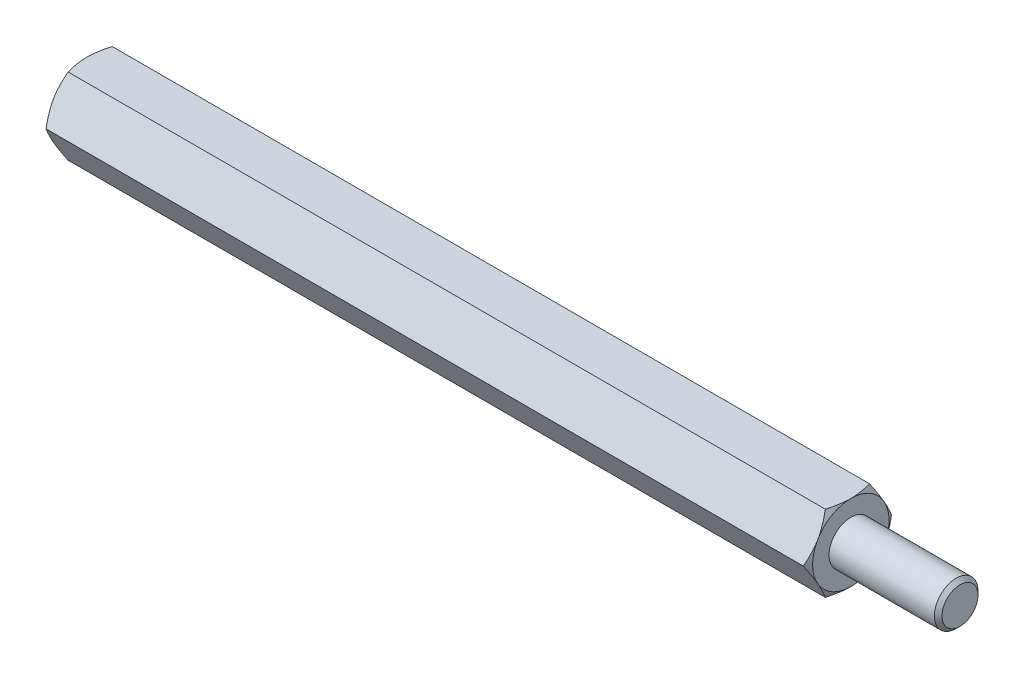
ISO-10303-21;
HEADER;
FILE_DESCRIPTION(('STEP AP214'),'2;1');
FILE_NAME('part.step','',(''),(''),'','','');
FILE_SCHEMA(('AUTOMOTIVE_DESIGN { 1 0 10303 214 1 1 1 1 }'));
ENDSEC;
DATA;
#1=APPLICATION_CONTEXT('core data for automotive mechanical design processes');
#2=APPLICATION_PROTOCOL_DEFINITION('international standard','automotive_design',2000,#1);
#3=PRODUCT_CONTEXT('',#1,'mechanical');
#4=PRODUCT('Part','Part','',(#3));
#5=PRODUCT_RELATED_PRODUCT_CATEGORY('part','',(#4));
#6=PRODUCT_DEFINITION_FORMATION('','',#4);
#7=PRODUCT_DEFINITION_CONTEXT('part definition',#1,'design');
#8=PRODUCT_DEFINITION('design','',#6,#7);
#9=PRODUCT_DEFINITION_SHAPE('','',#8);
#10=(LENGTH_UNIT() NAMED_UNIT(*) SI_UNIT(.MILLI.,.METRE.));
#11=(NAMED_UNIT(*) PLANE_ANGLE_UNIT() SI_UNIT($,.RADIAN.));
#12=(NAMED_UNIT(*) SI_UNIT($,.STERADIAN.) SOLID_ANGLE_UNIT());
#13=UNCERTAINTY_MEASURE_WITH_UNIT(LENGTH_MEASURE(1.E-05),#10,'distance_accuracy_value','');
#14=(GEOMETRIC_REPRESENTATION_CONTEXT(3) GLOBAL_UNCERTAINTY_ASSIGNED_CONTEXT((#13)) GLOBAL_UNIT_ASSIGNED_CONTEXT((#10,
#11,#12)) REPRESENTATION_CONTEXT('',''));
#15=CARTESIAN_POINT('',(0.,0.,0.));
#16=DIRECTION('',(0.,0.,1.));
#17=DIRECTION('',(1.,0.,0.));
#18=AXIS2_PLACEMENT_3D('',#15,#16,#17);
#19=CARTESIAN_POINT('',(35.,3.5,-2.02072594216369));
#20=DIRECTION('',(1.,0.,0.));
#21=DIRECTION('',(0.,0.,-1.));
#22=AXIS2_PLACEMENT_3D('',#19,#20,#21);
#23=PLANE('',#22);
#24=CARTESIAN_POINT('',(35.,0.,0.));
#25=DIRECTION('',(1.,0.,0.));
#26=DIRECTION('',(0.,0.,-1.));
#27=AXIS2_PLACEMENT_3D('',#24,#25,#26);
#28=CIRCLE('',#27,3.50000000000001);
#29=CARTESIAN_POINT('',(35.,-1.75000000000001,-3.03108891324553));
#30=VERTEX_POINT('',#29);
#31=CARTESIAN_POINT('',(35.,1.75,-3.03108891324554));
#32=VERTEX_POINT('',#31);
#33=EDGE_CURVE('E288',#30,#32,#28,.T.);
#34=ORIENTED_EDGE('',*,*,#33,.T.);
#35=CARTESIAN_POINT('',(35.,3.5,0.));
#36=VERTEX_POINT('',#35);
#37=EDGE_CURVE('E53',#32,#36,#28,.T.);
#38=ORIENTED_EDGE('',*,*,#37,.T.);
#39=CARTESIAN_POINT('',(35.,1.75,3.03108891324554));
#40=VERTEX_POINT('',#39);
#41=EDGE_CURVE('E296',#36,#40,#28,.T.);
#42=ORIENTED_EDGE('',*,*,#41,.T.);
#43=CARTESIAN_POINT('',(35.,-1.75000000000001,3.03108891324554));
#44=VERTEX_POINT('',#43);
#45=EDGE_CURVE('E302',#40,#44,#28,.T.);
#46=ORIENTED_EDGE('',*,*,#45,.T.);
#47=CARTESIAN_POINT('',(35.,0.,0.));
#48=DIRECTION('',(-1.,0.,0.));
#49=DIRECTION('',(0.,-1.,0.));
#50=AXIS2_PLACEMENT_3D('',#47,#48,#49);
#51=CIRCLE('',#50,3.50000000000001);
#52=CARTESIAN_POINT('',(35.,-3.50000000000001,0.));
#53=VERTEX_POINT('',#52);
#54=EDGE_CURVE('E193',#53,#44,#51,.T.);
#55=ORIENTED_EDGE('',*,*,#54,.F.);
#56=EDGE_CURVE('E61',#53,#30,#28,.T.);
#57=ORIENTED_EDGE('',*,*,#56,.T.);
#58=EDGE_LOOP('',(#34,#38,#42,#46,#55,#57));
#59=FACE_BOUND('',#58,.T.);
#60=CARTESIAN_POINT('',(35.,0.,0.));
#61=DIRECTION('',(1.,0.,0.));
#62=DIRECTION('',(0.,0.,-1.));
#63=AXIS2_PLACEMENT_3D('',#60,#61,#62);
#64=CIRCLE('',#63,2.);
#65=CARTESIAN_POINT('',(35.,0.,-2.));
#66=VERTEX_POINT('',#65);
#67=EDGE_CURVE('E327',#66,#66,#64,.T.);
#68=ORIENTED_EDGE('',*,*,#67,.F.);
#69=EDGE_LOOP('',(#68));
#70=FACE_BOUND('',#69,.T.);
#71=ADVANCED_FACE('F37',(#59,#70),#23,.T.);
#72=CARTESIAN_POINT('',(35.,0.,-4.04145188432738));
#73=DIRECTION('',(0.,-0.5,0.866025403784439));
#74=DIRECTION('',(0.,-0.866025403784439,-0.5));
#75=AXIS2_PLACEMENT_3D('',#72,#73,#74);
#76=PLANE('',#75);
#77=CARTESIAN_POINT('',(34.6873259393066,-0.000200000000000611,-4.04156735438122));
#78=CARTESIAN_POINT('',(34.73861421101,0.153607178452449,-3.9527667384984));
#79=CARTESIAN_POINT('',(34.7852590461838,0.308742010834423,-3.86319960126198));
#80=CARTESIAN_POINT('',(34.8666781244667,0.62169800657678,-3.68251437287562));
#81=CARTESIAN_POINT('',(34.9014235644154,0.779524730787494,-3.59139307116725));
#82=CARTESIAN_POINT('',(34.9555099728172,1.09322221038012,-3.41027974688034));
#83=CARTESIAN_POINT('',(34.9752109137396,1.24904469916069,-3.32031559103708));
#84=CARTESIAN_POINT('',(34.9987298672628,1.56142288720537,-3.13996396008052));
#85=CARTESIAN_POINT('',(35.0025673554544,1.71797745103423,-3.04957714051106));
#86=CARTESIAN_POINT('',(34.994584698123,2.01050921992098,-2.88068384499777));
#87=CARTESIAN_POINT('',(34.9847245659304,2.1465302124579,-2.80215208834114));
#88=CARTESIAN_POINT('',(34.9534735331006,2.41768602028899,-2.64560020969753));
#89=CARTESIAN_POINT('',(34.9320719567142,2.55281989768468,-2.5675806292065));
#90=CARTESIAN_POINT('',(34.8785695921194,2.82453479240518,-2.41070596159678));
#91=CARTESIAN_POINT('',(34.8462420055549,2.96108141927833,-2.33187072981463));
#92=CARTESIAN_POINT('',(34.772871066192,3.2321380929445,-2.17537608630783));
#93=CARTESIAN_POINT('',(34.7318449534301,3.36665161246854,-2.09771466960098));
#94=CARTESIAN_POINT('',(34.6873259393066,3.5002,-2.02061047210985));
#95=B_SPLINE_CURVE_WITH_KNOTS('',3,(#77,#78,#79,#80,#81,#82,#83,#84,#85,#86,#87,#88,#89,#90,#91,
#92,#93,#94),.UNSPECIFIED.,.F.,.F.,(4,2,2,2,2,2,2,2,4),(0.,0.554793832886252,1.11092123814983,
1.65328467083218,2.19498204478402,2.66665130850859,3.13875761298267,3.62133612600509,
4.10296698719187),.UNSPECIFIED.);
#96=CARTESIAN_POINT('',(34.6873926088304,0.,-4.04145188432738));
#97=VERTEX_POINT('',#96);
#98=EDGE_CURVE('E339',#97,#32,#95,.T.);
#99=ORIENTED_EDGE('',*,*,#98,.F.);
#100=DIRECTION('',(-1.,0.,0.));
#101=VECTOR('',#100,1.);
#102=CARTESIAN_POINT('',(35.,0.,-4.04145188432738));
#103=LINE('',#102,#101);
#104=CARTESIAN_POINT('',(-34.6873926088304,0.,-4.04145188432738));
#105=VERTEX_POINT('',#104);
#106=EDGE_CURVE('E264',#97,#105,#103,.T.);
#107=ORIENTED_EDGE('',*,*,#106,.T.);
#108=CARTESIAN_POINT('',(-34.6873259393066,3.5002,-2.02061047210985));
#109=CARTESIAN_POINT('',(-34.73861421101,3.34639282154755,-2.10941108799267));
#110=CARTESIAN_POINT('',(-34.7852590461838,3.19125798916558,-2.19897822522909));
#111=CARTESIAN_POINT('',(-34.8666781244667,2.87830199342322,-2.37966345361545));
#112=CARTESIAN_POINT('',(-34.9014235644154,2.7204752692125,-2.47078475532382));
#113=CARTESIAN_POINT('',(-34.9555099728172,2.40677778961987,-2.65189807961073));
#114=CARTESIAN_POINT('',(-34.9752109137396,2.25095530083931,-2.74186223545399));
#115=CARTESIAN_POINT('',(-34.9987298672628,1.93857711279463,-2.92221386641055));
#116=CARTESIAN_POINT('',(-35.0025673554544,1.78202254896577,-3.01260068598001));
#117=CARTESIAN_POINT('',(-34.994584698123,1.48949078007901,-3.1814939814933));
#118=CARTESIAN_POINT('',(-34.9847245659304,1.35346978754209,-3.26002573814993));
#119=CARTESIAN_POINT('',(-34.9534735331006,1.082313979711,-3.41657761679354));
#120=CARTESIAN_POINT('',(-34.9320719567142,0.947180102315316,-3.49459719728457));
#121=CARTESIAN_POINT('',(-34.8785695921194,0.675465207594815,-3.65147186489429));
#122=CARTESIAN_POINT('',(-34.8462420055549,0.538918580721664,-3.73030709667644));
#123=CARTESIAN_POINT('',(-34.772871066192,0.267861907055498,-3.88680174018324));
#124=CARTESIAN_POINT('',(-34.7318449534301,0.133348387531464,-3.96446315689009));
#125=CARTESIAN_POINT('',(-34.6873259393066,-0.000199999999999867,-4.04156735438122));
#126=B_SPLINE_CURVE_WITH_KNOTS('',3,(#108,#109,#110,#111,#112,#113,#114,#115,#116,#117,#118,
#119,#120,#121,#122,#123,#124,#125),.UNSPECIFIED.,.F.,.F.,(4,2,2,2,2,2,2,2,4),(0.,
0.554793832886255,1.11092123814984,1.65328467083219,2.19498204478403,2.6666513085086,
3.13875761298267,3.6213361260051,4.10296698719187),.UNSPECIFIED.);
#127=CARTESIAN_POINT('',(-35.,1.75,-3.03108891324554));
#128=VERTEX_POINT('',#127);
#129=EDGE_CURVE('E314',#128,#105,#126,.T.);
#130=ORIENTED_EDGE('',*,*,#129,.F.);
#131=CARTESIAN_POINT('',(-34.6873926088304,3.5,-2.02072594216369));
#132=VERTEX_POINT('',#131);
#133=EDGE_CURVE('E337',#132,#128,#126,.T.);
#134=ORIENTED_EDGE('',*,*,#133,.F.);
#135=DIRECTION('',(-1.,0.,0.));
#136=VECTOR('',#135,1.);
#137=CARTESIAN_POINT('',(35.,3.5,-2.02072594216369));
#138=LINE('',#137,#136);
#139=CARTESIAN_POINT('',(34.6873926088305,3.5,-2.02072594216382));
#140=VERTEX_POINT('',#139);
#141=EDGE_CURVE('E279',#140,#132,#138,.T.);
#142=ORIENTED_EDGE('',*,*,#141,.F.);
#143=EDGE_CURVE('E229',#32,#140,#95,.T.);
#144=ORIENTED_EDGE('',*,*,#143,.F.);
#145=EDGE_LOOP('',(#99,#107,#130,#134,#142,#144));
#146=FACE_BOUND('',#145,.T.);
#147=ADVANCED_FACE('F148',(#146),#76,.F.);
#148=CARTESIAN_POINT('',(35.,3.5,-2.02072594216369));
#149=DIRECTION('',(0.,-1.,0.));
#150=DIRECTION('',(0.,0.,-1.));
#151=AXIS2_PLACEMENT_3D('',#148,#149,#150);
#152=PLANE('',#151);
#153=CARTESIAN_POINT('',(33.2443294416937,3.5,-5.525713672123));
#154=CARTESIAN_POINT('',(33.3192813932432,3.5,-5.37200190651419));
#155=CARTESIAN_POINT('',(33.393542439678,3.5,-5.21794762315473));
#156=CARTESIAN_POINT('',(33.5402960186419,3.5,-4.90897223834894));
#157=CARTESIAN_POINT('',(33.6127882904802,3.5,-4.75405101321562));
#158=CARTESIAN_POINT('',(33.7559617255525,3.5,-4.44240758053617));
#159=CARTESIAN_POINT('',(33.8266316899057,3.5,-4.28568021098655));
#160=CARTESIAN_POINT('',(33.9652074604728,3.5,-3.97101270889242));
#161=CARTESIAN_POINT('',(34.0331133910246,3.5,-3.81307263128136));
#162=CARTESIAN_POINT('',(34.1677143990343,3.5,-3.49026114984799));
#163=CARTESIAN_POINT('',(34.2342871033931,3.5,-3.32533845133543));
#164=CARTESIAN_POINT('',(34.3626267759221,3.5,-2.99359992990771));
#165=CARTESIAN_POINT('',(34.4243932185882,3.5,-2.82678390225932));
#166=CARTESIAN_POINT('',(34.5415700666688,3.5,-2.49127529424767));
#167=CARTESIAN_POINT('',(34.5969925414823,3.5,-2.32258697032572));
#168=CARTESIAN_POINT('',(34.6997679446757,3.5,-1.98279215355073));
#169=CARTESIAN_POINT('',(34.7471233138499,3.5,-1.81168640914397));
#170=CARTESIAN_POINT('',(34.8312987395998,3.5,-1.46793354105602));
#171=CARTESIAN_POINT('',(34.8681796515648,3.5,-1.2953015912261));
#172=CARTESIAN_POINT('',(34.9293955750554,3.5,-0.947791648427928));
#173=CARTESIAN_POINT('',(34.953731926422,3.5,-0.772913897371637));
#174=CARTESIAN_POINT('',(34.9876038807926,3.5,-0.424108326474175));
#175=CARTESIAN_POINT('',(34.997337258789,3.5,-0.250200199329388));
#176=CARTESIAN_POINT('',(35.0017053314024,3.5,0.0978233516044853));
#177=CARTESIAN_POINT('',(34.9963399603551,3.5,0.271938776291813));
#178=CARTESIAN_POINT('',(34.9750118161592,3.5,0.564711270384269));
#179=CARTESIAN_POINT('',(34.9628919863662,3.5,0.6836676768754));
#180=CARTESIAN_POINT('',(34.9323080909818,3.5,0.920767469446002));
#181=CARTESIAN_POINT('',(34.9138432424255,3.5,1.03891075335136));
#182=CARTESIAN_POINT('',(34.8498956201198,3.5,1.39193174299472));
#183=CARTESIAN_POINT('',(34.7958695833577,3.5,1.62528232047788));
#184=CARTESIAN_POINT('',(34.7014515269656,3.5,1.97433825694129));
#185=CARTESIAN_POINT('',(34.6672900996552,3.5,2.09183268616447));
#186=CARTESIAN_POINT('',(34.595234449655,3.5,2.32568238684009));
#187=CARTESIAN_POINT('',(34.5573401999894,3.5,2.44203765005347));
#188=CARTESIAN_POINT('',(34.4784421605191,3.5,2.67364238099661));
#189=CARTESIAN_POINT('',(34.4374392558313,3.5,2.7888921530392));
#190=CARTESIAN_POINT('',(34.352824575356,3.5,3.0184246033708));
#191=CARTESIAN_POINT('',(34.3092128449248,3.5,3.13270729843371));
#192=CARTESIAN_POINT('',(34.1958241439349,3.5,3.42150510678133));
#193=CARTESIAN_POINT('',(34.1245636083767,3.5,3.59543696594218));
#194=CARTESIAN_POINT('',(33.9781026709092,3.5,3.94163961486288));
#195=CARTESIAN_POINT('',(33.9029019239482,3.5,4.11391025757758));
#196=CARTESIAN_POINT('',(33.7494252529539,3.5,4.45713072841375));
#197=CARTESIAN_POINT('',(33.6711484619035,3.5,4.62808016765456));
#198=CARTESIAN_POINT('',(33.512188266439,3.5,4.96885843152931));
#199=CARTESIAN_POINT('',(33.4315047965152,3.5,5.1386872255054));
#200=CARTESIAN_POINT('',(33.1863871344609,3.5,5.64726192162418));
#201=CARTESIAN_POINT('',(33.0190975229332,3.5,5.98463020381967));
#202=CARTESIAN_POINT('',(32.6795854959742,3.5,6.65678495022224));
#203=CARTESIAN_POINT('',(32.5073639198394,3.5,6.99157184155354));
#204=CARTESIAN_POINT('',(32.1760800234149,3.5,7.62749570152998));
#205=CARTESIAN_POINT('',(32.0173299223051,3.5,7.92879562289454));
#206=CARTESIAN_POINT('',(31.6977473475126,3.5,8.53030635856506));
#207=CARTESIAN_POINT('',(31.5369147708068,3.5,8.83051711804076));
#208=CARTESIAN_POINT('',(31.2141792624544,3.5,9.42918006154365));
#209=CARTESIAN_POINT('',(31.0522810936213,3.5,9.72763481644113));
#210=CARTESIAN_POINT('',(30.7272737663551,3.5,10.3238577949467));
#211=CARTESIAN_POINT('',(30.5641646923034,3.5,10.6216260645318));
#212=CARTESIAN_POINT('',(30.4006104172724,3.5,10.9191478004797));
#213=B_SPLINE_CURVE_WITH_KNOTS('',3,(#153,#154,#155,#156,#157,#158,#159,#160,#161,#162,#163,
#164,#165,#166,#167,#168,#169,#170,#171,#172,#173,#174,#175,#176,#177,#178,#179,#180,#181,#182,
#183,#184,#185,#186,#187,#188,#189,#190,#191,#192,#193,#194,#195,#196,#197,#198,#199,#200,#201,
#202,#203,#204,#205,#206,#207,#208,#209,#210,#211,#212),.UNSPECIFIED.,.F.,.F.,(4,2,2,2,2,2,2,2,
2,2,2,2,2,2,2,2,2,2,2,2,2,2,2,2,2,2,2,2,2,4),(0.,0.513041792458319,1.02615874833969,
1.54190801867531,2.05763406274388,2.59113284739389,3.1246898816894,3.65721433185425,
4.18957737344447,4.71878103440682,5.24792816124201,5.76984197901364,6.29175806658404,
6.65030258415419,7.00889136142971,7.72642330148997,8.0934692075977,8.46051776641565,
8.82746220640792,9.19440026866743,9.75822236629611,10.3220939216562,10.8861255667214,
11.4501725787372,12.579801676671,13.7092396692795,14.730918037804,15.7526471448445,
16.771258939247,17.7898004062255),.UNSPECIFIED.);
#214=EDGE_CURVE('E227',#140,#36,#213,.T.);
#215=ORIENTED_EDGE('',*,*,#214,.F.);
#216=ORIENTED_EDGE('',*,*,#141,.T.);
#217=CARTESIAN_POINT('',(-33.2443294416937,3.5,-5.525713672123));
#218=CARTESIAN_POINT('',(-33.3192813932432,3.5,-5.37200190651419));
#219=CARTESIAN_POINT('',(-33.393542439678,3.5,-5.21794762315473));
#220=CARTESIAN_POINT('',(-33.5402960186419,3.5,-4.90897223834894));
#221=CARTESIAN_POINT('',(-33.6127882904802,3.5,-4.75405101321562));
#222=CARTESIAN_POINT('',(-33.7559617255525,3.5,-4.44240758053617));
#223=CARTESIAN_POINT('',(-33.8266316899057,3.5,-4.28568021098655));
#224=CARTESIAN_POINT('',(-33.9652074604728,3.5,-3.97101270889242));
#225=CARTESIAN_POINT('',(-34.0331133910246,3.5,-3.81307263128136));
#226=CARTESIAN_POINT('',(-34.1677143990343,3.5,-3.49026114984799));
#227=CARTESIAN_POINT('',(-34.2342871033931,3.5,-3.32533845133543));
#228=CARTESIAN_POINT('',(-34.3626267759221,3.5,-2.99359992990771));
#229=CARTESIAN_POINT('',(-34.4243932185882,3.5,-2.82678390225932));
#230=CARTESIAN_POINT('',(-34.5415700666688,3.5,-2.49127529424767));
#231=CARTESIAN_POINT('',(-34.5969925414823,3.5,-2.32258697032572));
#232=CARTESIAN_POINT('',(-34.6997679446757,3.5,-1.98279215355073));
#233=CARTESIAN_POINT('',(-34.7471233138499,3.5,-1.81168640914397));
#234=CARTESIAN_POINT('',(-34.8312987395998,3.5,-1.46793354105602));
#235=CARTESIAN_POINT('',(-34.8681796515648,3.5,-1.2953015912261));
#236=CARTESIAN_POINT('',(-34.9293955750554,3.5,-0.947791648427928));
#237=CARTESIAN_POINT('',(-34.953731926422,3.5,-0.772913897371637));
#238=CARTESIAN_POINT('',(-34.9876038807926,3.5,-0.424108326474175));
#239=CARTESIAN_POINT('',(-34.997337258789,3.5,-0.250200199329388));
#240=CARTESIAN_POINT('',(-35.0017053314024,3.5,0.0978233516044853));
#241=CARTESIAN_POINT('',(-34.9963399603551,3.5,0.271938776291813));
#242=CARTESIAN_POINT('',(-34.9750118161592,3.5,0.564711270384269));
#243=CARTESIAN_POINT('',(-34.9628919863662,3.5,0.6836676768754));
#244=CARTESIAN_POINT('',(-34.9323080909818,3.5,0.920767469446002));
#245=CARTESIAN_POINT('',(-34.9138432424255,3.5,1.03891075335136));
#246=CARTESIAN_POINT('',(-34.8498956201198,3.5,1.39193174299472));
#247=CARTESIAN_POINT('',(-34.7958695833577,3.5,1.62528232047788));
#248=CARTESIAN_POINT('',(-34.7014515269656,3.5,1.97433825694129));
#249=CARTESIAN_POINT('',(-34.6672900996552,3.5,2.09183268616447));
#250=CARTESIAN_POINT('',(-34.595234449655,3.5,2.32568238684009));
#251=CARTESIAN_POINT('',(-34.5573401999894,3.5,2.44203765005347));
#252=CARTESIAN_POINT('',(-34.4784421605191,3.5,2.67364238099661));
#253=CARTESIAN_POINT('',(-34.4374392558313,3.5,2.7888921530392));
#254=CARTESIAN_POINT('',(-34.352824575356,3.5,3.0184246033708));
#255=CARTESIAN_POINT('',(-34.3092128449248,3.5,3.13270729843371));
#256=CARTESIAN_POINT('',(-34.1958241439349,3.5,3.42150510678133));
#257=CARTESIAN_POINT('',(-34.1245636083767,3.5,3.59543696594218));
#258=CARTESIAN_POINT('',(-33.9781026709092,3.5,3.94163961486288));
#259=CARTESIAN_POINT('',(-33.9029019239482,3.5,4.11391025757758));
#260=CARTESIAN_POINT('',(-33.7494252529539,3.5,4.45713072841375));
#261=CARTESIAN_POINT('',(-33.6711484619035,3.5,4.62808016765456));
#262=CARTESIAN_POINT('',(-33.512188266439,3.5,4.96885843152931));
#263=CARTESIAN_POINT('',(-33.4315047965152,3.5,5.1386872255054));
#264=CARTESIAN_POINT('',(-33.1863871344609,3.5,5.64726192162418));
#265=CARTESIAN_POINT('',(-33.0190975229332,3.5,5.98463020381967));
#266=CARTESIAN_POINT('',(-32.6795854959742,3.5,6.65678495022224));
#267=CARTESIAN_POINT('',(-32.5073639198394,3.5,6.99157184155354));
#268=CARTESIAN_POINT('',(-32.1760800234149,3.5,7.62749570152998));
#269=CARTESIAN_POINT('',(-32.0173299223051,3.5,7.92879562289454));
#270=CARTESIAN_POINT('',(-31.6977473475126,3.5,8.53030635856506));
#271=CARTESIAN_POINT('',(-31.5369147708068,3.5,8.83051711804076));
#272=CARTESIAN_POINT('',(-31.2141792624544,3.5,9.42918006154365));
#273=CARTESIAN_POINT('',(-31.0522810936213,3.5,9.72763481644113));
#274=CARTESIAN_POINT('',(-30.7272737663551,3.5,10.3238577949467));
#275=CARTESIAN_POINT('',(-30.5641646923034,3.5,10.6216260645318));
#276=CARTESIAN_POINT('',(-30.4006104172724,3.5,10.9191478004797));
#277=B_SPLINE_CURVE_WITH_KNOTS('',3,(#217,#218,#219,#220,#221,#222,#223,#224,#225,#226,#227,
#228,#229,#230,#231,#232,#233,#234,#235,#236,#237,#238,#239,#240,#241,#242,#243,#244,#245,#246,
#247,#248,#249,#250,#251,#252,#253,#254,#255,#256,#257,#258,#259,#260,#261,#262,#263,#264,#265,
#266,#267,#268,#269,#270,#271,#272,#273,#274,#275,#276),.UNSPECIFIED.,.F.,.F.,(4,2,2,2,2,2,2,2,
2,2,2,2,2,2,2,2,2,2,2,2,2,2,2,2,2,2,2,2,2,4),(0.,0.513041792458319,1.02615874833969,
1.54190801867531,2.05763406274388,2.59113284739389,3.1246898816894,3.65721433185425,
4.18957737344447,4.71878103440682,5.24792816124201,5.76984197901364,6.29175806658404,
6.65030258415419,7.00889136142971,7.72642330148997,8.0934692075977,8.46051776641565,
8.82746220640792,9.19440026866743,9.75822236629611,10.3220939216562,10.8861255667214,
11.4501725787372,12.579801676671,13.7092396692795,14.730918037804,15.7526471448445,
16.771258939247,17.7898004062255),.UNSPECIFIED.);
#278=CARTESIAN_POINT('',(-35.,3.5,0.));
#279=VERTEX_POINT('',#278);
#280=EDGE_CURVE('E241',#279,#132,#277,.F.);
#281=ORIENTED_EDGE('',*,*,#280,.F.);
#282=CARTESIAN_POINT('',(-34.6873926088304,3.5,2.02072594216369));
#283=VERTEX_POINT('',#282);
#284=EDGE_CURVE('E249',#283,#279,#277,.F.);
#285=ORIENTED_EDGE('',*,*,#284,.F.);
#286=DIRECTION('',(-1.,0.,0.));
#287=VECTOR('',#286,1.);
#288=CARTESIAN_POINT('',(35.,3.5,2.02072594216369));
#289=LINE('',#288,#287);
#290=CARTESIAN_POINT('',(34.6873926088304,3.5,2.02072594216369));
#291=VERTEX_POINT('',#290);
#292=EDGE_CURVE('E276',#291,#283,#289,.T.);
#293=ORIENTED_EDGE('',*,*,#292,.F.);
#294=EDGE_CURVE('E221',#36,#291,#213,.T.);
#295=ORIENTED_EDGE('',*,*,#294,.F.);
#296=EDGE_LOOP('',(#215,#216,#281,#285,#293,#295));
#297=FACE_BOUND('',#296,.T.);
#298=ADVANCED_FACE('F153',(#297),#152,.F.);
#299=CARTESIAN_POINT('',(35.,3.5,2.02072594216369));
#300=DIRECTION('',(0.,-0.5,-0.866025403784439));
#301=DIRECTION('',(0.,0.866025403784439,-0.5));
#302=AXIS2_PLACEMENT_3D('',#299,#300,#301);
#303=PLANE('',#302);
#304=CARTESIAN_POINT('',(34.6873259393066,3.5002,2.02061047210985));
#305=CARTESIAN_POINT('',(34.73861421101,3.34639282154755,2.10941108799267));
#306=CARTESIAN_POINT('',(34.7852590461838,3.19125798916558,2.19897822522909));
#307=CARTESIAN_POINT('',(34.8666781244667,2.87830199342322,2.37966345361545));
#308=CARTESIAN_POINT('',(34.9014235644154,2.7204752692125,2.47078475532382));
#309=CARTESIAN_POINT('',(34.9555099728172,2.40677778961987,2.65189807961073));
#310=CARTESIAN_POINT('',(34.9752109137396,2.25095530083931,2.74186223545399));
#311=CARTESIAN_POINT('',(34.9987298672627,1.93857711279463,2.92221386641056));
#312=CARTESIAN_POINT('',(35.0025673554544,1.78202254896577,3.01260068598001));
#313=CARTESIAN_POINT('',(34.994584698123,1.48949078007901,3.1814939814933));
#314=CARTESIAN_POINT('',(34.9847245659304,1.35346978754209,3.26002573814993));
#315=CARTESIAN_POINT('',(34.9534735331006,1.082313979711,3.41657761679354));
#316=CARTESIAN_POINT('',(34.9320719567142,0.947180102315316,3.49459719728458));
#317=CARTESIAN_POINT('',(34.8785695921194,0.675465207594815,3.65147186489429));
#318=CARTESIAN_POINT('',(34.8462420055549,0.538918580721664,3.73030709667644));
#319=CARTESIAN_POINT('',(34.772871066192,0.267861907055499,3.88680174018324));
#320=CARTESIAN_POINT('',(34.7318449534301,0.133348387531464,3.96446315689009));
#321=CARTESIAN_POINT('',(34.6873259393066,-0.000199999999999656,4.04156735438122));
#322=B_SPLINE_CURVE_WITH_KNOTS('',3,(#304,#305,#306,#307,#308,#309,#310,#311,#312,#313,#314,
#315,#316,#317,#318,#319,#320,#321),.UNSPECIFIED.,.F.,.F.,(4,2,2,2,2,2,2,2,4),(0.,
0.554793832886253,1.11092123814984,1.65328467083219,2.19498204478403,2.6666513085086,
3.13875761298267,3.62133612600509,4.10296698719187),.UNSPECIFIED.);
#323=EDGE_CURVE('E228',#291,#40,#322,.T.);
#324=ORIENTED_EDGE('',*,*,#323,.F.);
#325=ORIENTED_EDGE('',*,*,#292,.T.);
#326=CARTESIAN_POINT('',(-34.6873259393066,-0.00020000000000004,4.04156735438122));
#327=CARTESIAN_POINT('',(-34.73861421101,0.153607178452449,3.9527667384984));
#328=CARTESIAN_POINT('',(-34.7852590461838,0.308742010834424,3.86319960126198));
#329=CARTESIAN_POINT('',(-34.8666781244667,0.621698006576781,3.68251437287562));
#330=CARTESIAN_POINT('',(-34.9014235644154,0.779524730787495,3.59139307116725));
#331=CARTESIAN_POINT('',(-34.9555099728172,1.09322221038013,3.41027974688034));
#332=CARTESIAN_POINT('',(-34.9752109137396,1.24904469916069,3.32031559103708));
#333=CARTESIAN_POINT('',(-34.9987298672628,1.56142288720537,3.13996396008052));
#334=CARTESIAN_POINT('',(-35.0025673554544,1.71797745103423,3.04957714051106));
#335=CARTESIAN_POINT('',(-34.994584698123,2.01050921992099,2.88068384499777));
#336=CARTESIAN_POINT('',(-34.9847245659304,2.1465302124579,2.80215208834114));
#337=CARTESIAN_POINT('',(-34.9534735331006,2.41768602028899,2.64560020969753));
#338=CARTESIAN_POINT('',(-34.9320719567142,2.55281989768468,2.5675806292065));
#339=CARTESIAN_POINT('',(-34.8785695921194,2.82453479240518,2.41070596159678));
#340=CARTESIAN_POINT('',(-34.8462420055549,2.96108141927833,2.33187072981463));
#341=CARTESIAN_POINT('',(-34.772871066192,3.2321380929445,2.17537608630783));
#342=CARTESIAN_POINT('',(-34.7318449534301,3.36665161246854,2.09771466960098));
#343=CARTESIAN_POINT('',(-34.6873259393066,3.5002,2.02061047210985));
#344=B_SPLINE_CURVE_WITH_KNOTS('',3,(#326,#327,#328,#329,#330,#331,#332,#333,#334,#335,#336,
#337,#338,#339,#340,#341,#342,#343),.UNSPECIFIED.,.F.,.F.,(4,2,2,2,2,2,2,2,4),(0.,
0.554793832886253,1.11092123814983,1.65328467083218,2.19498204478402,2.66665130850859,
3.13875761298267,3.62133612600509,4.10296698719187),.UNSPECIFIED.);
#345=CARTESIAN_POINT('',(-35.,1.75,3.03108891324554));
#346=VERTEX_POINT('',#345);
#347=EDGE_CURVE('E255',#346,#283,#344,.T.);
#348=ORIENTED_EDGE('',*,*,#347,.F.);
#349=CARTESIAN_POINT('',(-34.6873926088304,0.,4.04145188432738));
#350=VERTEX_POINT('',#349);
#351=EDGE_CURVE('E262',#350,#346,#344,.T.);
#352=ORIENTED_EDGE('',*,*,#351,.F.);
#353=DIRECTION('',(-1.,0.,0.));
#354=VECTOR('',#353,1.);
#355=CARTESIAN_POINT('',(35.,0.,4.04145188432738));
#356=LINE('',#355,#354);
#357=CARTESIAN_POINT('',(34.6873926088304,0.,4.04145188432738));
#358=VERTEX_POINT('',#357);
#359=EDGE_CURVE('E273',#358,#350,#356,.T.);
#360=ORIENTED_EDGE('',*,*,#359,.F.);
#361=EDGE_CURVE('E215',#40,#358,#322,.T.);
#362=ORIENTED_EDGE('',*,*,#361,.F.);
#363=EDGE_LOOP('',(#324,#325,#348,#352,#360,#362));
#364=FACE_BOUND('',#363,.T.);
#365=ADVANCED_FACE('F235',(#364),#303,.F.);
#366=CARTESIAN_POINT('',(35.,0.,4.04145188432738));
#367=DIRECTION('',(0.,0.5,-0.866025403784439));
#368=DIRECTION('',(0.,0.866025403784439,0.5));
#369=AXIS2_PLACEMENT_3D('',#366,#367,#368);
#370=PLANE('',#369);
#371=CARTESIAN_POINT('',(34.6873259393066,0.000199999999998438,4.04156735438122));
#372=CARTESIAN_POINT('',(34.73861421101,-0.153607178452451,3.9527667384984));
#373=CARTESIAN_POINT('',(34.7852590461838,-0.308742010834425,3.86319960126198));
#374=CARTESIAN_POINT('',(34.8666781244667,-0.621698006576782,3.68251437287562));
#375=CARTESIAN_POINT('',(34.9014235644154,-0.779524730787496,3.59139307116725));
#376=CARTESIAN_POINT('',(34.9555099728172,-1.09322221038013,3.41027974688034));
#377=CARTESIAN_POINT('',(34.9752109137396,-1.24904469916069,3.32031559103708));
#378=CARTESIAN_POINT('',(34.9987298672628,-1.56142288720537,3.13996396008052));
#379=CARTESIAN_POINT('',(35.0025673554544,-1.71797745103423,3.04957714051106));
#380=CARTESIAN_POINT('',(34.994584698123,-2.01050921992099,2.88068384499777));
#381=CARTESIAN_POINT('',(34.9847245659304,-2.1465302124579,2.80215208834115));
#382=CARTESIAN_POINT('',(34.9534735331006,-2.41768602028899,2.64560020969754));
#383=CARTESIAN_POINT('',(34.9320719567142,-2.55281989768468,2.5675806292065));
#384=CARTESIAN_POINT('',(34.8785695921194,-2.82453479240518,2.41070596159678));
#385=CARTESIAN_POINT('',(34.8462420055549,-2.96108141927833,2.33187072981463));
#386=CARTESIAN_POINT('',(34.772871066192,-3.2321380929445,2.17537608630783));
#387=CARTESIAN_POINT('',(34.7318449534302,-3.36665161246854,2.09771466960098));
#388=CARTESIAN_POINT('',(34.6873259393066,-3.5002,2.02061047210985));
#389=B_SPLINE_CURVE_WITH_KNOTS('',3,(#371,#372,#373,#374,#375,#376,#377,#378,#379,#380,#381,
#382,#383,#384,#385,#386,#387,#388),.UNSPECIFIED.,.F.,.F.,(4,2,2,2,2,2,2,2,4),(0.,
0.554793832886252,1.11092123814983,1.65328467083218,2.19498204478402,2.66665130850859,
3.13875761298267,3.62133612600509,4.10296698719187),.UNSPECIFIED.);
#390=EDGE_CURVE('E342',#358,#44,#389,.T.);
#391=ORIENTED_EDGE('',*,*,#390,.F.);
#392=ORIENTED_EDGE('',*,*,#359,.T.);
#393=CARTESIAN_POINT('',(-34.6873259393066,-3.5002,2.02061047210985));
#394=CARTESIAN_POINT('',(-34.73861421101,-3.34639282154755,2.10941108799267));
#395=CARTESIAN_POINT('',(-34.7852590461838,-3.19125798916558,2.19897822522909));
#396=CARTESIAN_POINT('',(-34.8666781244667,-2.87830199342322,2.37966345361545));
#397=CARTESIAN_POINT('',(-34.9014235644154,-2.72047526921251,2.47078475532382));
#398=CARTESIAN_POINT('',(-34.9555099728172,-2.40677778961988,2.65189807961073));
#399=CARTESIAN_POINT('',(-34.9752109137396,-2.25095530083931,2.74186223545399));
#400=CARTESIAN_POINT('',(-34.9987298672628,-1.93857711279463,2.92221386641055));
#401=CARTESIAN_POINT('',(-35.0025673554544,-1.78202254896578,3.01260068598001));
#402=CARTESIAN_POINT('',(-34.994584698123,-1.48949078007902,3.18149398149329));
#403=CARTESIAN_POINT('',(-34.9847245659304,-1.3534697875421,3.26002573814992));
#404=CARTESIAN_POINT('',(-34.9534735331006,-1.08231397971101,3.41657761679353));
#405=CARTESIAN_POINT('',(-34.9320719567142,-0.947180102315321,3.49459719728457));
#406=CARTESIAN_POINT('',(-34.8785695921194,-0.67546520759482,3.65147186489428));
#407=CARTESIAN_POINT('',(-34.8462420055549,-0.538918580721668,3.73030709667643));
#408=CARTESIAN_POINT('',(-34.772871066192,-0.267861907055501,3.88680174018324));
#409=CARTESIAN_POINT('',(-34.7318449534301,-0.133348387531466,3.96446315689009));
#410=CARTESIAN_POINT('',(-34.6873259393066,0.000199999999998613,4.04156735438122));
#411=B_SPLINE_CURVE_WITH_KNOTS('',3,(#393,#394,#395,#396,#397,#398,#399,#400,#401,#402,#403,
#404,#405,#406,#407,#408,#409,#410),.UNSPECIFIED.,.F.,.F.,(4,2,2,2,2,2,2,2,4),(0.,
0.554793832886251,1.11092123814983,1.65328467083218,2.19498204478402,2.66665130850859,
3.13875761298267,3.62133612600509,4.10296698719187),.UNSPECIFIED.);
#412=CARTESIAN_POINT('',(-35.,-1.75000000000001,3.03108891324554));
#413=VERTEX_POINT('',#412);
#414=EDGE_CURVE('E263',#413,#350,#411,.T.);
#415=ORIENTED_EDGE('',*,*,#414,.F.);
#416=CARTESIAN_POINT('',(-34.6873926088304,-3.5,2.02072594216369));
#417=VERTEX_POINT('',#416);
#418=EDGE_CURVE('E250',#417,#413,#411,.T.);
#419=ORIENTED_EDGE('',*,*,#418,.F.);
#420=DIRECTION('',(-1.,0.,0.));
#421=VECTOR('',#420,1.);
#422=CARTESIAN_POINT('',(35.,-3.5,2.02072594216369));
#423=LINE('',#422,#421);
#424=CARTESIAN_POINT('',(34.6873926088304,-3.5,2.02072594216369));
#425=VERTEX_POINT('',#424);
#426=EDGE_CURVE('E270',#425,#417,#423,.T.);
#427=ORIENTED_EDGE('',*,*,#426,.F.);
#428=EDGE_CURVE('E210',#44,#425,#389,.T.);
#429=ORIENTED_EDGE('',*,*,#428,.F.);
#430=EDGE_LOOP('',(#391,#392,#415,#419,#427,#429));
#431=FACE_BOUND('',#430,.T.);
#432=ADVANCED_FACE('F401',(#431),#370,.F.);
#433=CARTESIAN_POINT('',(35.,-3.5,2.02072594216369));
#434=DIRECTION('',(0.,1.,0.));
#435=DIRECTION('',(0.,0.,1.));
#436=AXIS2_PLACEMENT_3D('',#433,#434,#435);
#437=PLANE('',#436);
#438=CARTESIAN_POINT('',(33.2443294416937,-3.5,-5.52571367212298));
#439=CARTESIAN_POINT('',(33.3192813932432,-3.5,-5.37200190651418));
#440=CARTESIAN_POINT('',(33.393542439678,-3.5,-5.21794762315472));
#441=CARTESIAN_POINT('',(33.5402960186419,-3.5,-4.90897223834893));
#442=CARTESIAN_POINT('',(33.6127882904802,-3.5,-4.75405101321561));
#443=CARTESIAN_POINT('',(33.7559617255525,-3.5,-4.44240758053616));
#444=CARTESIAN_POINT('',(33.8266316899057,-3.5,-4.28568021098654));
#445=CARTESIAN_POINT('',(33.9652074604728,-3.5,-3.97101270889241));
#446=CARTESIAN_POINT('',(34.0331133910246,-3.5,-3.81307263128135));
#447=CARTESIAN_POINT('',(34.1677143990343,-3.5,-3.49026114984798));
#448=CARTESIAN_POINT('',(34.2342871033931,-3.5,-3.32533845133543));
#449=CARTESIAN_POINT('',(34.3626267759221,-3.5,-2.99359992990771));
#450=CARTESIAN_POINT('',(34.4243932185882,-3.5,-2.82678390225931));
#451=CARTESIAN_POINT('',(34.5415700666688,-3.5,-2.49127529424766));
#452=CARTESIAN_POINT('',(34.5969925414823,-3.5,-2.32258697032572));
#453=CARTESIAN_POINT('',(34.6997679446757,-3.5,-1.98279215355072));
#454=CARTESIAN_POINT('',(34.7471233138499,-3.5,-1.81168640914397));
#455=CARTESIAN_POINT('',(34.8312987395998,-3.5,-1.46793354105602));
#456=CARTESIAN_POINT('',(34.8681796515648,-3.5,-1.2953015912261));
#457=CARTESIAN_POINT('',(34.9293955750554,-3.5,-0.947791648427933));
#458=CARTESIAN_POINT('',(34.953731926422,-3.5,-0.772913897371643));
#459=CARTESIAN_POINT('',(34.9876038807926,-3.5,-0.424108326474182));
#460=CARTESIAN_POINT('',(34.997337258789,-3.5,-0.250200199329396));
#461=CARTESIAN_POINT('',(35.0017053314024,-3.5,0.0978233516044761));
#462=CARTESIAN_POINT('',(34.9963399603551,-3.5,0.271938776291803));
#463=CARTESIAN_POINT('',(34.9750118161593,-3.5,0.564711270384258));
#464=CARTESIAN_POINT('',(34.9628919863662,-3.5,0.683667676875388));
#465=CARTESIAN_POINT('',(34.9323080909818,-3.5,0.920767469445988));
#466=CARTESIAN_POINT('',(34.9138432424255,-3.5,1.03891075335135));
#467=CARTESIAN_POINT('',(34.8498956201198,-3.5,1.3919317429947));
#468=CARTESIAN_POINT('',(34.7958695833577,-3.5,1.62528232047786));
#469=CARTESIAN_POINT('',(34.7014515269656,-3.5,1.97433825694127));
#470=CARTESIAN_POINT('',(34.6672900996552,-3.5,2.09183268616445));
#471=CARTESIAN_POINT('',(34.5952344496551,-3.5,2.32568238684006));
#472=CARTESIAN_POINT('',(34.5573401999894,-3.5,2.44203765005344));
#473=CARTESIAN_POINT('',(34.4784421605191,-3.5,2.67364238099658));
#474=CARTESIAN_POINT('',(34.4374392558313,-3.5,2.78889215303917));
#475=CARTESIAN_POINT('',(34.352824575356,-3.5,3.01842460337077));
#476=CARTESIAN_POINT('',(34.3092128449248,-3.5,3.13270729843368));
#477=CARTESIAN_POINT('',(34.1958241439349,-3.5,3.4215051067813));
#478=CARTESIAN_POINT('',(34.1245636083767,-3.5,3.59543696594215));
#479=CARTESIAN_POINT('',(33.9781026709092,-3.5,3.94163961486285));
#480=CARTESIAN_POINT('',(33.9029019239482,-3.5,4.11391025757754));
#481=CARTESIAN_POINT('',(33.7494252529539,-3.5,4.45713072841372));
#482=CARTESIAN_POINT('',(33.6711484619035,-3.5,4.62808016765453));
#483=CARTESIAN_POINT('',(33.5121882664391,-3.5,4.96885843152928));
#484=CARTESIAN_POINT('',(33.4315047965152,-3.5,5.13868722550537));
#485=CARTESIAN_POINT('',(33.186387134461,-3.5,5.64726192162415));
#486=CARTESIAN_POINT('',(33.0190975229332,-3.5,5.98463020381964));
#487=CARTESIAN_POINT('',(32.6795854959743,-3.5,6.65678495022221));
#488=CARTESIAN_POINT('',(32.5073639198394,-3.5,6.9915718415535));
#489=CARTESIAN_POINT('',(32.176080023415,-3.5,7.62749570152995));
#490=CARTESIAN_POINT('',(32.0173299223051,-3.5,7.92879562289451));
#491=CARTESIAN_POINT('',(31.6977473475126,-3.5,8.53030635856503));
#492=CARTESIAN_POINT('',(31.5369147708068,-3.5,8.83051711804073));
#493=CARTESIAN_POINT('',(31.2141792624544,-3.5,9.42918006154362));
#494=CARTESIAN_POINT('',(31.0522810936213,-3.5,9.7276348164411));
#495=CARTESIAN_POINT('',(30.7272737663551,-3.5,10.3238577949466));
#496=CARTESIAN_POINT('',(30.5641646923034,-3.5,10.6216260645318));
#497=CARTESIAN_POINT('',(30.4006104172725,-3.5,10.9191478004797));
#498=B_SPLINE_CURVE_WITH_KNOTS('',3,(#438,#439,#440,#441,#442,#443,#444,#445,#446,#447,#448,
#449,#450,#451,#452,#453,#454,#455,#456,#457,#458,#459,#460,#461,#462,#463,#464,#465,#466,#467,
#468,#469,#470,#471,#472,#473,#474,#475,#476,#477,#478,#479,#480,#481,#482,#483,#484,#485,#486,
#487,#488,#489,#490,#491,#492,#493,#494,#495,#496,#497),.UNSPECIFIED.,.F.,.F.,(4,2,2,2,2,2,2,2,
2,2,2,2,2,2,2,2,2,2,2,2,2,2,2,2,2,2,2,2,2,4),(0.,0.513041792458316,1.02615874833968,
1.5419080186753,2.05763406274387,2.59113284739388,3.12468988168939,3.65721433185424,
4.18957737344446,4.7187810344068,5.24792816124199,5.76984197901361,6.29175806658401,
6.65030258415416,7.00889136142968,7.72642330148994,8.09346920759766,8.4605177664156,
8.82746220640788,9.19440026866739,9.75822236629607,10.3220939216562,10.8861255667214,
11.4501725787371,12.579801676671,13.7092396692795,14.730918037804,15.7526471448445,
16.7712589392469,17.7898004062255),.UNSPECIFIED.);
#499=EDGE_CURVE('E316',#425,#53,#498,.F.);
#500=ORIENTED_EDGE('',*,*,#499,.F.);
#501=ORIENTED_EDGE('',*,*,#426,.T.);
#502=CARTESIAN_POINT('',(-33.2443294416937,-3.5,-5.52571367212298));
#503=CARTESIAN_POINT('',(-33.3192813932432,-3.5,-5.37200190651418));
#504=CARTESIAN_POINT('',(-33.393542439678,-3.5,-5.21794762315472));
#505=CARTESIAN_POINT('',(-33.5402960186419,-3.5,-4.90897223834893));
#506=CARTESIAN_POINT('',(-33.6127882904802,-3.5,-4.75405101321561));
#507=CARTESIAN_POINT('',(-33.7559617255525,-3.5,-4.44240758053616));
#508=CARTESIAN_POINT('',(-33.8266316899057,-3.5,-4.28568021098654));
#509=CARTESIAN_POINT('',(-33.9652074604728,-3.5,-3.97101270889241));
#510=CARTESIAN_POINT('',(-34.0331133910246,-3.5,-3.81307263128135));
#511=CARTESIAN_POINT('',(-34.1677143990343,-3.5,-3.49026114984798));
#512=CARTESIAN_POINT('',(-34.2342871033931,-3.5,-3.32533845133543));
#513=CARTESIAN_POINT('',(-34.3626267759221,-3.5,-2.99359992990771));
#514=CARTESIAN_POINT('',(-34.4243932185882,-3.5,-2.82678390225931));
#515=CARTESIAN_POINT('',(-34.5415700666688,-3.5,-2.49127529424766));
#516=CARTESIAN_POINT('',(-34.5969925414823,-3.5,-2.32258697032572));
#517=CARTESIAN_POINT('',(-34.6997679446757,-3.5,-1.98279215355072));
#518=CARTESIAN_POINT('',(-34.7471233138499,-3.5,-1.81168640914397));
#519=CARTESIAN_POINT('',(-34.8312987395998,-3.5,-1.46793354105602));
#520=CARTESIAN_POINT('',(-34.8681796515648,-3.5,-1.2953015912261));
#521=CARTESIAN_POINT('',(-34.9293955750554,-3.5,-0.947791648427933));
#522=CARTESIAN_POINT('',(-34.953731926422,-3.5,-0.772913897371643));
#523=CARTESIAN_POINT('',(-34.9876038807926,-3.5,-0.424108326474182));
#524=CARTESIAN_POINT('',(-34.997337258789,-3.5,-0.250200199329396));
#525=CARTESIAN_POINT('',(-35.0017053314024,-3.5,0.0978233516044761));
#526=CARTESIAN_POINT('',(-34.9963399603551,-3.5,0.271938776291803));
#527=CARTESIAN_POINT('',(-34.9750118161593,-3.5,0.564711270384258));
#528=CARTESIAN_POINT('',(-34.9628919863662,-3.5,0.683667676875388));
#529=CARTESIAN_POINT('',(-34.9323080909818,-3.5,0.920767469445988));
#530=CARTESIAN_POINT('',(-34.9138432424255,-3.5,1.03891075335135));
#531=CARTESIAN_POINT('',(-34.8498956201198,-3.5,1.3919317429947));
#532=CARTESIAN_POINT('',(-34.7958695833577,-3.5,1.62528232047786));
#533=CARTESIAN_POINT('',(-34.7014515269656,-3.5,1.97433825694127));
#534=CARTESIAN_POINT('',(-34.6672900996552,-3.5,2.09183268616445));
#535=CARTESIAN_POINT('',(-34.5952344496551,-3.5,2.32568238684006));
#536=CARTESIAN_POINT('',(-34.5573401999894,-3.5,2.44203765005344));
#537=CARTESIAN_POINT('',(-34.4784421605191,-3.5,2.67364238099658));
#538=CARTESIAN_POINT('',(-34.4374392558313,-3.5,2.78889215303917));
#539=CARTESIAN_POINT('',(-34.352824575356,-3.5,3.01842460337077));
#540=CARTESIAN_POINT('',(-34.3092128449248,-3.5,3.13270729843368));
#541=CARTESIAN_POINT('',(-34.1958241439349,-3.5,3.4215051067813));
#542=CARTESIAN_POINT('',(-34.1245636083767,-3.5,3.59543696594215));
#543=CARTESIAN_POINT('',(-33.9781026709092,-3.5,3.94163961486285));
#544=CARTESIAN_POINT('',(-33.9029019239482,-3.5,4.11391025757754));
#545=CARTESIAN_POINT('',(-33.7494252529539,-3.5,4.45713072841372));
#546=CARTESIAN_POINT('',(-33.6711484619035,-3.5,4.62808016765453));
#547=CARTESIAN_POINT('',(-33.5121882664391,-3.5,4.96885843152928));
#548=CARTESIAN_POINT('',(-33.4315047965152,-3.5,5.13868722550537));
#549=CARTESIAN_POINT('',(-33.186387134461,-3.5,5.64726192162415));
#550=CARTESIAN_POINT('',(-33.0190975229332,-3.5,5.98463020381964));
#551=CARTESIAN_POINT('',(-32.6795854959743,-3.5,6.65678495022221));
#552=CARTESIAN_POINT('',(-32.5073639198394,-3.5,6.9915718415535));
#553=CARTESIAN_POINT('',(-32.176080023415,-3.5,7.62749570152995));
#554=CARTESIAN_POINT('',(-32.0173299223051,-3.5,7.92879562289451));
#555=CARTESIAN_POINT('',(-31.6977473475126,-3.5,8.53030635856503));
#556=CARTESIAN_POINT('',(-31.5369147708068,-3.5,8.83051711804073));
#557=CARTESIAN_POINT('',(-31.2141792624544,-3.5,9.42918006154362));
#558=CARTESIAN_POINT('',(-31.0522810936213,-3.5,9.7276348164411));
#559=CARTESIAN_POINT('',(-30.7272737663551,-3.5,10.3238577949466));
#560=CARTESIAN_POINT('',(-30.5641646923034,-3.5,10.6216260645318));
#561=CARTESIAN_POINT('',(-30.4006104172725,-3.5,10.9191478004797));
#562=B_SPLINE_CURVE_WITH_KNOTS('',3,(#502,#503,#504,#505,#506,#507,#508,#509,#510,#511,#512,
#513,#514,#515,#516,#517,#518,#519,#520,#521,#522,#523,#524,#525,#526,#527,#528,#529,#530,#531,
#532,#533,#534,#535,#536,#537,#538,#539,#540,#541,#542,#543,#544,#545,#546,#547,#548,#549,#550,
#551,#552,#553,#554,#555,#556,#557,#558,#559,#560,#561),.UNSPECIFIED.,.F.,.F.,(4,2,2,2,2,2,2,2,
2,2,2,2,2,2,2,2,2,2,2,2,2,2,2,2,2,2,2,2,2,4),(0.,0.513041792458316,1.02615874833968,
1.5419080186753,2.05763406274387,2.59113284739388,3.12468988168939,3.65721433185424,
4.18957737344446,4.7187810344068,5.24792816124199,5.76984197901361,6.29175806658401,
6.65030258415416,7.00889136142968,7.72642330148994,8.09346920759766,8.4605177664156,
8.82746220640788,9.19440026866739,9.75822236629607,10.3220939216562,10.8861255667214,
11.4501725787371,12.579801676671,13.7092396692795,14.730918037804,15.7526471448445,
16.7712589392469,17.7898004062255),.UNSPECIFIED.);
#563=CARTESIAN_POINT('',(-35.,-3.50000000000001,0.));
#564=VERTEX_POINT('',#563);
#565=EDGE_CURVE('E334',#564,#417,#562,.T.);
#566=ORIENTED_EDGE('',*,*,#565,.F.);
#567=CARTESIAN_POINT('',(-34.6873926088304,-3.5,-2.02072594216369));
#568=VERTEX_POINT('',#567);
#569=EDGE_CURVE('E338',#568,#564,#562,.T.);
#570=ORIENTED_EDGE('',*,*,#569,.F.);
#571=DIRECTION('',(-1.,0.,0.));
#572=VECTOR('',#571,1.);
#573=CARTESIAN_POINT('',(35.,-3.5,-2.02072594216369));
#574=LINE('',#573,#572);
#575=CARTESIAN_POINT('',(34.6873926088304,-3.5,-2.02072594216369));
#576=VERTEX_POINT('',#575);
#577=EDGE_CURVE('E267',#576,#568,#574,.T.);
#578=ORIENTED_EDGE('',*,*,#577,.F.);
#579=EDGE_CURVE('E195',#53,#576,#498,.F.);
#580=ORIENTED_EDGE('',*,*,#579,.F.);
#581=EDGE_LOOP('',(#500,#501,#566,#570,#578,#580));
#582=FACE_BOUND('',#581,.T.);
#583=ADVANCED_FACE('F172',(#582),#437,.F.);
#584=CARTESIAN_POINT('',(35.,-3.5,-2.02072594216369));
#585=DIRECTION('',(0.,0.5,0.866025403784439));
#586=DIRECTION('',(0.,-0.866025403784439,0.5));
#587=AXIS2_PLACEMENT_3D('',#584,#585,#586);
#588=PLANE('',#587);
#589=CARTESIAN_POINT('',(34.6873259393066,-3.5002,-2.02061047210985));
#590=CARTESIAN_POINT('',(34.73861421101,-3.34639282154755,-2.10941108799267));
#591=CARTESIAN_POINT('',(34.7852590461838,-3.19125798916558,-2.19897822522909));
#592=CARTESIAN_POINT('',(34.8666781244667,-2.87830199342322,-2.37966345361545));
#593=CARTESIAN_POINT('',(34.9014235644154,-2.72047526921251,-2.47078475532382));
#594=CARTESIAN_POINT('',(34.9555099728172,-2.40677778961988,-2.65189807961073));
#595=CARTESIAN_POINT('',(34.9752109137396,-2.25095530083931,-2.74186223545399));
#596=CARTESIAN_POINT('',(34.9987298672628,-1.93857711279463,-2.92221386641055));
#597=CARTESIAN_POINT('',(35.0025673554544,-1.78202254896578,-3.01260068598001));
#598=CARTESIAN_POINT('',(34.994584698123,-1.48949078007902,-3.1814939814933));
#599=CARTESIAN_POINT('',(34.9847245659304,-1.3534697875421,-3.26002573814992));
#600=CARTESIAN_POINT('',(34.9534735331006,-1.08231397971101,-3.41657761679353));
#601=CARTESIAN_POINT('',(34.9320719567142,-0.94718010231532,-3.49459719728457));
#602=CARTESIAN_POINT('',(34.8785695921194,-0.675465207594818,-3.65147186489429));
#603=CARTESIAN_POINT('',(34.8462420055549,-0.538918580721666,-3.73030709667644));
#604=CARTESIAN_POINT('',(34.772871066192,-0.267861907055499,-3.88680174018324));
#605=CARTESIAN_POINT('',(34.7318449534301,-0.133348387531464,-3.96446315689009));
#606=CARTESIAN_POINT('',(34.6873259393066,0.000199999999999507,-4.04156735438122));
#607=B_SPLINE_CURVE_WITH_KNOTS('',3,(#589,#590,#591,#592,#593,#594,#595,#596,#597,#598,#599,
#600,#601,#602,#603,#604,#605,#606),.UNSPECIFIED.,.F.,.F.,(4,2,2,2,2,2,2,2,4),(0.,
0.554793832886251,1.11092123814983,1.65328467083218,2.19498204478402,2.66665130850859,
3.13875761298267,3.6213361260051,4.10296698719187),.UNSPECIFIED.);
#608=EDGE_CURVE('E192',#576,#30,#607,.T.);
#609=ORIENTED_EDGE('',*,*,#608,.F.);
#610=ORIENTED_EDGE('',*,*,#577,.T.);
#611=CARTESIAN_POINT('',(-34.6873259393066,0.000199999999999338,-4.04156735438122));
#612=CARTESIAN_POINT('',(-34.73861421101,-0.15360717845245,-3.9527667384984));
#613=CARTESIAN_POINT('',(-34.7852590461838,-0.308742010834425,-3.86319960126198));
#614=CARTESIAN_POINT('',(-34.8666781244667,-0.621698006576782,-3.68251437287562));
#615=CARTESIAN_POINT('',(-34.9014235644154,-0.779524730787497,-3.59139307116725));
#616=CARTESIAN_POINT('',(-34.9555099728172,-1.09322221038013,-3.41027974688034));
#617=CARTESIAN_POINT('',(-34.9752109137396,-1.24904469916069,-3.32031559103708));
#618=CARTESIAN_POINT('',(-34.9987298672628,-1.56142288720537,-3.13996396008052));
#619=CARTESIAN_POINT('',(-35.0025673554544,-1.71797745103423,-3.04957714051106));
#620=CARTESIAN_POINT('',(-34.994584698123,-2.01050921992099,-2.88068384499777));
#621=CARTESIAN_POINT('',(-34.9847245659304,-2.14653021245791,-2.80215208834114));
#622=CARTESIAN_POINT('',(-34.9534735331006,-2.41768602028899,-2.64560020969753));
#623=CARTESIAN_POINT('',(-34.9320719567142,-2.55281989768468,-2.5675806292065));
#624=CARTESIAN_POINT('',(-34.8785695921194,-2.82453479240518,-2.41070596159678));
#625=CARTESIAN_POINT('',(-34.8462420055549,-2.96108141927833,-2.33187072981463));
#626=CARTESIAN_POINT('',(-34.772871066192,-3.2321380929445,-2.17537608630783));
#627=CARTESIAN_POINT('',(-34.7318449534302,-3.36665161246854,-2.09771466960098));
#628=CARTESIAN_POINT('',(-34.6873259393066,-3.5002,-2.02061047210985));
#629=B_SPLINE_CURVE_WITH_KNOTS('',3,(#611,#612,#613,#614,#615,#616,#617,#618,#619,#620,#621,
#622,#623,#624,#625,#626,#627,#628),.UNSPECIFIED.,.F.,.F.,(4,2,2,2,2,2,2,2,4),(0.,
0.554793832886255,1.11092123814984,1.65328467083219,2.19498204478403,2.6666513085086,
3.13875761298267,3.62133612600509,4.10296698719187),.UNSPECIFIED.);
#630=CARTESIAN_POINT('',(-35.,-1.75000000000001,-3.03108891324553));
#631=VERTEX_POINT('',#630);
#632=EDGE_CURVE('E178',#631,#568,#629,.T.);
#633=ORIENTED_EDGE('',*,*,#632,.F.);
#634=EDGE_CURVE('E381',#105,#631,#629,.T.);
#635=ORIENTED_EDGE('',*,*,#634,.F.);
#636=ORIENTED_EDGE('',*,*,#106,.F.);
#637=EDGE_CURVE('E185',#30,#97,#607,.T.);
#638=ORIENTED_EDGE('',*,*,#637,.F.);
#639=EDGE_LOOP('',(#609,#610,#633,#635,#636,#638));
#640=FACE_BOUND('',#639,.T.);
#641=ADVANCED_FACE('F167',(#640),#588,.F.);
#642=CARTESIAN_POINT('',(-35.,0.,0.));
#643=DIRECTION('',(1.,0.,0.));
#644=DIRECTION('',(0.,1.,0.));
#645=AXIS2_PLACEMENT_3D('',#642,#643,#644);
#646=CONICAL_SURFACE('',#645,3.50000000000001,1.0471975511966);
#647=ORIENTED_EDGE('',*,*,#129,.T.);
#648=ORIENTED_EDGE('',*,*,#634,.T.);
#649=CARTESIAN_POINT('',(-35.,0.,0.));
#650=DIRECTION('',(1.,0.,0.));
#651=DIRECTION('',(0.,0.,-1.));
#652=AXIS2_PLACEMENT_3D('',#649,#650,#651);
#653=CIRCLE('',#652,3.50000000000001);
#654=EDGE_CURVE('E282',#631,#128,#653,.T.);
#655=ORIENTED_EDGE('',*,*,#654,.T.);
#656=EDGE_LOOP('',(#647,#648,#655));
#657=FACE_BOUND('',#656,.T.);
#658=ADVANCED_FACE('F171',(#657),#646,.T.);
#659=ORIENTED_EDGE('',*,*,#569,.T.);
#660=EDGE_CURVE('E286',#564,#631,#653,.T.);
#661=ORIENTED_EDGE('',*,*,#660,.T.);
#662=ORIENTED_EDGE('',*,*,#632,.T.);
#663=EDGE_LOOP('',(#659,#661,#662));
#664=FACE_BOUND('',#663,.T.);
#665=ADVANCED_FACE('F419',(#664),#646,.T.);
#666=ORIENTED_EDGE('',*,*,#418,.T.);
#667=CARTESIAN_POINT('',(-35.,0.,0.));
#668=DIRECTION('',(-1.,0.,0.));
#669=DIRECTION('',(0.,-1.,0.));
#670=AXIS2_PLACEMENT_3D('',#667,#668,#669);
#671=CIRCLE('',#670,3.50000000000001);
#672=EDGE_CURVE('E346',#564,#413,#671,.T.);
#673=ORIENTED_EDGE('',*,*,#672,.F.);
#674=ORIENTED_EDGE('',*,*,#565,.T.);
#675=EDGE_LOOP('',(#666,#673,#674));
#676=FACE_BOUND('',#675,.T.);
#677=ADVANCED_FACE('F417',(#676),#646,.T.);
#678=ORIENTED_EDGE('',*,*,#351,.T.);
#679=EDGE_CURVE('E366',#346,#413,#653,.T.);
#680=ORIENTED_EDGE('',*,*,#679,.T.);
#681=ORIENTED_EDGE('',*,*,#414,.T.);
#682=EDGE_LOOP('',(#678,#680,#681));
#683=FACE_BOUND('',#682,.T.);
#684=ADVANCED_FACE('F158',(#683),#646,.T.);
#685=ORIENTED_EDGE('',*,*,#347,.T.);
#686=ORIENTED_EDGE('',*,*,#284,.T.);
#687=EDGE_CURVE('E353',#279,#346,#653,.T.);
#688=ORIENTED_EDGE('',*,*,#687,.T.);
#689=EDGE_LOOP('',(#685,#686,#688));
#690=FACE_BOUND('',#689,.T.);
#691=ADVANCED_FACE('F351',(#690),#646,.T.);
#692=ORIENTED_EDGE('',*,*,#280,.T.);
#693=ORIENTED_EDGE('',*,*,#133,.T.);
#694=EDGE_CURVE('E287',#128,#279,#653,.T.);
#695=ORIENTED_EDGE('',*,*,#694,.T.);
#696=EDGE_LOOP('',(#692,#693,#695));
#697=FACE_BOUND('',#696,.T.);
#698=ADVANCED_FACE('F165',(#697),#646,.T.);
#699=CARTESIAN_POINT('',(-35.,3.5,-2.02072594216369));
#700=DIRECTION('',(1.,0.,0.));
#701=DIRECTION('',(0.,0.,-1.));
#702=AXIS2_PLACEMENT_3D('',#699,#700,#701);
#703=PLANE('',#702);
#704=CARTESIAN_POINT('',(-35.,0.,0.));
#705=DIRECTION('',(-1.,0.,0.));
#706=DIRECTION('',(0.,0.,1.));
#707=AXIS2_PLACEMENT_3D('',#704,#705,#706);
#708=CIRCLE('',#707,1.65);
#709=CARTESIAN_POINT('',(-35.,0.,1.65));
#710=VERTEX_POINT('',#709);
#711=EDGE_CURVE('E318',#710,#710,#708,.T.);
#712=ORIENTED_EDGE('',*,*,#711,.F.);
#713=EDGE_LOOP('',(#712));
#714=FACE_BOUND('',#713,.T.);
#715=ORIENTED_EDGE('',*,*,#694,.F.);
#716=ORIENTED_EDGE('',*,*,#654,.F.);
#717=ORIENTED_EDGE('',*,*,#660,.F.);
#718=ORIENTED_EDGE('',*,*,#672,.T.);
#719=ORIENTED_EDGE('',*,*,#679,.F.);
#720=ORIENTED_EDGE('',*,*,#687,.F.);
#721=EDGE_LOOP('',(#715,#716,#717,#718,#719,#720));
#722=FACE_BOUND('',#721,.T.);
#723=ADVANCED_FACE('F161',(#714,#722),#703,.F.);
#724=CARTESIAN_POINT('',(35.,0.,0.));
#725=DIRECTION('',(-1.,0.,0.));
#726=DIRECTION('',(0.,1.,0.));
#727=AXIS2_PLACEMENT_3D('',#724,#725,#726);
#728=CONICAL_SURFACE('',#727,3.50000000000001,1.0471975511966);
#729=ORIENTED_EDGE('',*,*,#98,.T.);
#730=ORIENTED_EDGE('',*,*,#33,.F.);
#731=ORIENTED_EDGE('',*,*,#637,.T.);
#732=EDGE_LOOP('',(#729,#730,#731));
#733=FACE_BOUND('',#732,.T.);
#734=ADVANCED_FACE('F164',(#733),#728,.T.);
#735=ORIENTED_EDGE('',*,*,#579,.T.);
#736=ORIENTED_EDGE('',*,*,#608,.T.);
#737=ORIENTED_EDGE('',*,*,#56,.F.);
#738=EDGE_LOOP('',(#735,#736,#737));
#739=FACE_BOUND('',#738,.T.);
#740=ADVANCED_FACE('F202',(#739),#728,.T.);
#741=ORIENTED_EDGE('',*,*,#428,.T.);
#742=ORIENTED_EDGE('',*,*,#499,.T.);
#743=ORIENTED_EDGE('',*,*,#54,.T.);
#744=EDGE_LOOP('',(#741,#742,#743));
#745=FACE_BOUND('',#744,.T.);
#746=ADVANCED_FACE('F544',(#745),#728,.T.);
#747=ORIENTED_EDGE('',*,*,#361,.T.);
#748=ORIENTED_EDGE('',*,*,#390,.T.);
#749=ORIENTED_EDGE('',*,*,#45,.F.);
#750=EDGE_LOOP('',(#747,#748,#749));
#751=FACE_BOUND('',#750,.T.);
#752=ADVANCED_FACE('F414',(#751),#728,.T.);
#753=ORIENTED_EDGE('',*,*,#294,.T.);
#754=ORIENTED_EDGE('',*,*,#323,.T.);
#755=ORIENTED_EDGE('',*,*,#41,.F.);
#756=EDGE_LOOP('',(#753,#754,#755));
#757=FACE_BOUND('',#756,.T.);
#758=ADVANCED_FACE('F530',(#757),#728,.T.);
#759=ORIENTED_EDGE('',*,*,#143,.T.);
#760=ORIENTED_EDGE('',*,*,#214,.T.);
#761=ORIENTED_EDGE('',*,*,#37,.F.);
#762=EDGE_LOOP('',(#759,#760,#761));
#763=FACE_BOUND('',#762,.T.);
#764=ADVANCED_FACE('F143',(#763),#728,.T.);
#765=CARTESIAN_POINT('',(-25.,0.,0.));
#766=DIRECTION('',(-1.,0.,0.));
#767=DIRECTION('',(0.,0.,1.));
#768=AXIS2_PLACEMENT_3D('',#765,#766,#767);
#769=CYLINDRICAL_SURFACE('',#768,1.65);
#770=CARTESIAN_POINT('',(-25.,0.,0.));
#771=DIRECTION('',(1.,0.,0.));
#772=DIRECTION('',(0.,0.,-1.));
#773=AXIS2_PLACEMENT_3D('',#770,#771,#772);
#774=CIRCLE('',#773,1.65);
#775=CARTESIAN_POINT('',(-25.,0.,-1.65));
#776=VERTEX_POINT('',#775);
#777=EDGE_CURVE('E322',#776,#776,#774,.T.);
#778=ORIENTED_EDGE('',*,*,#777,.T.);
#779=EDGE_LOOP('',(#778));
#780=FACE_BOUND('',#779,.T.);
#781=ORIENTED_EDGE('',*,*,#711,.T.);
#782=EDGE_LOOP('',(#781));
#783=FACE_BOUND('',#782,.T.);
#784=ADVANCED_FACE('F133',(#780,#783),#769,.F.);
#785=CARTESIAN_POINT('',(-24.0473720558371,0.,0.));
#786=DIRECTION('',(-1.,0.,0.));
#787=DIRECTION('',(0.,0.,1.));
#788=AXIS2_PLACEMENT_3D('',#785,#786,#787);
#789=CONICAL_SURFACE('',#788,0.,1.0471975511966);
#790=ORIENTED_EDGE('',*,*,#777,.F.);
#791=EDGE_LOOP('',(#790));
#792=FACE_BOUND('',#791,.T.);
#793=CARTESIAN_POINT('',(-24.0473720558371,0.,0.));
#794=VERTEX_POINT('',#793);
#795=VERTEX_LOOP('',#794);
#796=FACE_BOUND('',#795,.T.);
#797=ADVANCED_FACE('F130',(#792,#796),#789,.F.);
#798=CARTESIAN_POINT('',(45.,0.,0.));
#799=DIRECTION('',(-1.,0.,0.));
#800=DIRECTION('',(0.,0.,1.));
#801=AXIS2_PLACEMENT_3D('',#798,#799,#800);
#802=CYLINDRICAL_SURFACE('',#801,2.);
#803=CARTESIAN_POINT('',(44.65,0.,0.));
#804=DIRECTION('',(1.,0.,0.));
#805=DIRECTION('',(0.,0.,-1.));
#806=AXIS2_PLACEMENT_3D('',#803,#804,#805);
#807=CIRCLE('',#806,2.);
#808=CARTESIAN_POINT('',(44.65,0.,-2.));
#809=VERTEX_POINT('',#808);
#810=EDGE_CURVE('E11',#809,#809,#807,.F.);
#811=ORIENTED_EDGE('',*,*,#810,.T.);
#812=EDGE_LOOP('',(#811));
#813=FACE_BOUND('',#812,.T.);
#814=ORIENTED_EDGE('',*,*,#67,.T.);
#815=EDGE_LOOP('',(#814));
#816=FACE_BOUND('',#815,.T.);
#817=ADVANCED_FACE('F132',(#813,#816),#802,.T.);
#818=CARTESIAN_POINT('',(45.,0.,0.));
#819=DIRECTION('',(1.,0.,0.));
#820=DIRECTION('',(0.,0.,-1.));
#821=AXIS2_PLACEMENT_3D('',#818,#819,#820);
#822=PLANE('',#821);
#823=CARTESIAN_POINT('',(45.,0.,0.));
#824=DIRECTION('',(1.,0.,0.));
#825=DIRECTION('',(0.,0.,-1.));
#826=AXIS2_PLACEMENT_3D('',#823,#824,#825);
#827=CIRCLE('',#826,1.64999999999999);
#828=CARTESIAN_POINT('',(45.,0.,-1.64999999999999));
#829=VERTEX_POINT('',#828);
#830=EDGE_CURVE('E46',#829,#829,#827,.T.);
#831=ORIENTED_EDGE('',*,*,#830,.T.);
#832=EDGE_LOOP('',(#831));
#833=FACE_BOUND('',#832,.T.);
#834=ADVANCED_FACE('F140',(#833),#822,.T.);
#835=CARTESIAN_POINT('',(45.,0.,0.));
#836=DIRECTION('',(-1.,0.,0.));
#837=DIRECTION('',(0.,0.,1.));
#838=AXIS2_PLACEMENT_3D('',#835,#836,#837);
#839=CONICAL_SURFACE('',#838,1.64999999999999,0.785398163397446);
#840=ORIENTED_EDGE('',*,*,#810,.F.);
#841=EDGE_LOOP('',(#840));
#842=FACE_BOUND('',#841,.T.);
#843=ORIENTED_EDGE('',*,*,#830,.F.);
#844=EDGE_LOOP('',(#843));
#845=FACE_BOUND('',#844,.T.);
#846=ADVANCED_FACE('F39',(#842,#845),#839,.T.);
#847=CLOSED_SHELL('',(#71,#147,#298,#365,#432,#583,#641,#658,#665,#677,#684,#691,#698,#723,#734,
#740,#746,#752,#758,#764,#784,#797,#817,#834,#846));
#848=MANIFOLD_SOLID_BREP('B2',#847);
#849=ADVANCED_BREP_SHAPE_REPRESENTATION('',(#18,#848),#14);
#850=SHAPE_DEFINITION_REPRESENTATION(#9,#849);
ENDSEC;
END-ISO-10303-21;
